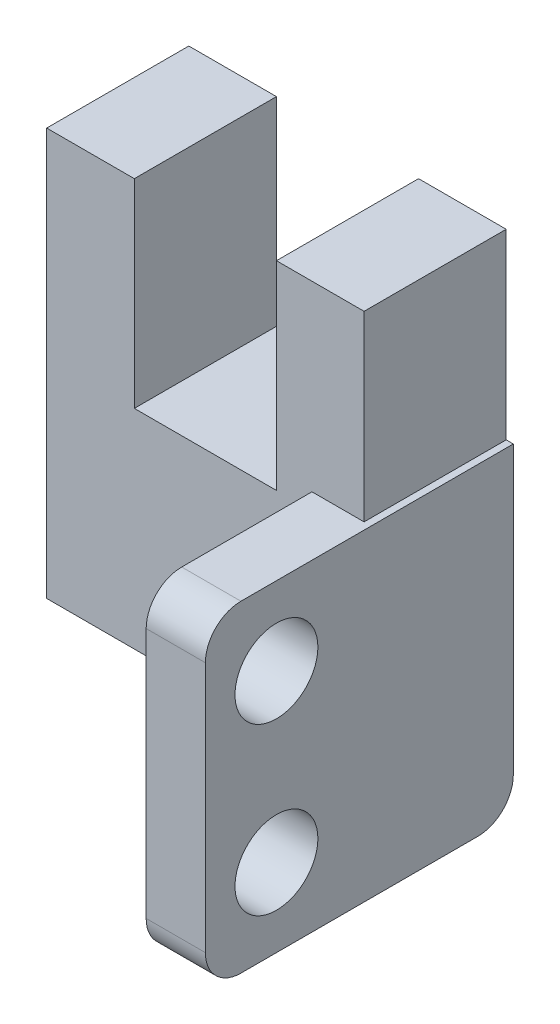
ISO-10303-21;
HEADER;
FILE_DESCRIPTION(('STEP AP214'),'2;1');
FILE_NAME('part.step','',(''),(''),'','','');
FILE_SCHEMA(('AUTOMOTIVE_DESIGN { 1 0 10303 214 1 1 1 1 }'));
ENDSEC;
DATA;
#1=APPLICATION_CONTEXT('core data for automotive mechanical design processes');
#2=APPLICATION_PROTOCOL_DEFINITION('international standard','automotive_design',2000,#1);
#3=PRODUCT_CONTEXT('',#1,'mechanical');
#4=PRODUCT('Part','Part','',(#3));
#5=PRODUCT_RELATED_PRODUCT_CATEGORY('part','',(#4));
#6=PRODUCT_DEFINITION_FORMATION('','',#4);
#7=PRODUCT_DEFINITION_CONTEXT('part definition',#1,'design');
#8=PRODUCT_DEFINITION('design','',#6,#7);
#9=PRODUCT_DEFINITION_SHAPE('','',#8);
#10=(LENGTH_UNIT() NAMED_UNIT(*) SI_UNIT(.MILLI.,.METRE.));
#11=(NAMED_UNIT(*) PLANE_ANGLE_UNIT() SI_UNIT($,.RADIAN.));
#12=(NAMED_UNIT(*) SI_UNIT($,.STERADIAN.) SOLID_ANGLE_UNIT());
#13=UNCERTAINTY_MEASURE_WITH_UNIT(LENGTH_MEASURE(1.E-05),#10,'distance_accuracy_value','');
#14=(GEOMETRIC_REPRESENTATION_CONTEXT(3) GLOBAL_UNCERTAINTY_ASSIGNED_CONTEXT((#13)) GLOBAL_UNIT_ASSIGNED_CONTEXT((#10,
#11,#12)) REPRESENTATION_CONTEXT('',''));
#15=CARTESIAN_POINT('',(0.,0.,0.));
#16=DIRECTION('',(0.,0.,1.));
#17=DIRECTION('',(1.,0.,0.));
#18=AXIS2_PLACEMENT_3D('',#15,#16,#17);
#19=CARTESIAN_POINT('',(10.9,9.5,13.));
#20=DIRECTION('',(0.,1.,0.));
#21=DIRECTION('',(0.,0.,1.));
#22=AXIS2_PLACEMENT_3D('',#19,#20,#21);
#23=PLANE('',#22);
#24=DIRECTION('',(0.,0.,-1.));
#25=VECTOR('',#24,1.);
#26=CARTESIAN_POINT('',(11.2,9.5,13.));
#27=LINE('',#26,#25);
#28=CARTESIAN_POINT('',(11.2,9.5,11.5));
#29=VERTEX_POINT('',#28);
#30=CARTESIAN_POINT('',(11.2,9.5,6.));
#31=VERTEX_POINT('',#30);
#32=EDGE_CURVE('E148',#29,#31,#27,.T.);
#33=ORIENTED_EDGE('',*,*,#32,.F.);
#34=DIRECTION('',(1.,0.,0.));
#35=VECTOR('',#34,1.);
#36=CARTESIAN_POINT('',(10.9,9.5,11.5));
#37=LINE('',#36,#35);
#38=CARTESIAN_POINT('',(13.7,9.5,11.5));
#39=VERTEX_POINT('',#38);
#40=EDGE_CURVE('E11',#29,#39,#37,.T.);
#41=ORIENTED_EDGE('',*,*,#40,.T.);
#42=DIRECTION('',(0.,0.,1.));
#43=VECTOR('',#42,1.);
#44=CARTESIAN_POINT('',(13.7,9.5,0.));
#45=LINE('',#44,#43);
#46=CARTESIAN_POINT('',(13.7,9.5,0.));
#47=VERTEX_POINT('',#46);
#48=EDGE_CURVE('E177',#47,#39,#45,.T.);
#49=ORIENTED_EDGE('',*,*,#48,.F.);
#50=DIRECTION('',(-1.,0.,0.));
#51=VECTOR('',#50,1.);
#52=CARTESIAN_POINT('',(13.7,9.5,0.));
#53=LINE('',#52,#51);
#54=CARTESIAN_POINT('',(13.4,9.5,0.));
#55=VERTEX_POINT('',#54);
#56=EDGE_CURVE('E173',#47,#55,#53,.T.);
#57=ORIENTED_EDGE('',*,*,#56,.T.);
#58=DIRECTION('',(0.,0.,1.));
#59=VECTOR('',#58,1.);
#60=CARTESIAN_POINT('',(13.4,9.5,0.));
#61=LINE('',#60,#59);
#62=CARTESIAN_POINT('',(13.4,9.5,6.));
#63=VERTEX_POINT('',#62);
#64=EDGE_CURVE('E171',#55,#63,#61,.T.);
#65=ORIENTED_EDGE('',*,*,#64,.T.);
#66=DIRECTION('',(1.,0.,0.));
#67=VECTOR('',#66,1.);
#68=CARTESIAN_POINT('',(0.,9.5,6.));
#69=LINE('',#68,#67);
#70=EDGE_CURVE('E163',#31,#63,#69,.T.);
#71=ORIENTED_EDGE('',*,*,#70,.F.);
#72=EDGE_LOOP('',(#33,#41,#49,#57,#65,#71));
#73=FACE_BOUND('',#72,.T.);
#74=ADVANCED_FACE('F35',(#73),#23,.T.);
#75=CARTESIAN_POINT('',(10.9,-4.1,0.));
#76=DIRECTION('',(0.,-1.,0.));
#77=DIRECTION('',(0.,0.,-1.));
#78=AXIS2_PLACEMENT_3D('',#75,#76,#77);
#79=PLANE('',#78);
#80=DIRECTION('',(0.,0.,1.));
#81=VECTOR('',#80,1.);
#82=CARTESIAN_POINT('',(11.2,-4.1,0.));
#83=LINE('',#82,#81);
#84=CARTESIAN_POINT('',(11.2,-4.1,1.5));
#85=VERTEX_POINT('',#84);
#86=CARTESIAN_POINT('',(11.2,-4.1,11.5));
#87=VERTEX_POINT('',#86);
#88=EDGE_CURVE('E349',#85,#87,#83,.T.);
#89=ORIENTED_EDGE('',*,*,#88,.F.);
#90=DIRECTION('',(1.,0.,0.));
#91=VECTOR('',#90,1.);
#92=CARTESIAN_POINT('',(10.9,-4.1,1.5));
#93=LINE('',#92,#91);
#94=CARTESIAN_POINT('',(13.7,-4.1,1.5));
#95=VERTEX_POINT('',#94);
#96=EDGE_CURVE('E239',#85,#95,#93,.T.);
#97=ORIENTED_EDGE('',*,*,#96,.T.);
#98=DIRECTION('',(0.,0.,-1.));
#99=VECTOR('',#98,1.);
#100=CARTESIAN_POINT('',(13.7,-4.1,13.));
#101=LINE('',#100,#99);
#102=CARTESIAN_POINT('',(13.7,-4.1,11.5));
#103=VERTEX_POINT('',#102);
#104=EDGE_CURVE('E267',#103,#95,#101,.T.);
#105=ORIENTED_EDGE('',*,*,#104,.F.);
#106=DIRECTION('',(1.,0.,0.));
#107=VECTOR('',#106,1.);
#108=CARTESIAN_POINT('',(10.9,-4.1,11.5));
#109=LINE('',#108,#107);
#110=EDGE_CURVE('E237',#103,#87,#109,.F.);
#111=ORIENTED_EDGE('',*,*,#110,.T.);
#112=EDGE_LOOP('',(#89,#97,#105,#111));
#113=FACE_BOUND('',#112,.T.);
#114=ADVANCED_FACE('F287',(#113),#79,.T.);
#115=CARTESIAN_POINT('',(10.9,-4.1,13.));
#116=DIRECTION('',(0.,0.,1.));
#117=DIRECTION('',(1.,0.,0.));
#118=AXIS2_PLACEMENT_3D('',#115,#116,#117);
#119=PLANE('',#118);
#120=DIRECTION('',(0.,1.,0.));
#121=VECTOR('',#120,1.);
#122=CARTESIAN_POINT('',(11.2,-4.1,13.));
#123=LINE('',#122,#121);
#124=CARTESIAN_POINT('',(11.2,-2.6,13.));
#125=VERTEX_POINT('',#124);
#126=CARTESIAN_POINT('',(11.2,8.,13.));
#127=VERTEX_POINT('',#126);
#128=EDGE_CURVE('E159',#125,#127,#123,.T.);
#129=ORIENTED_EDGE('',*,*,#128,.F.);
#130=DIRECTION('',(1.,0.,0.));
#131=VECTOR('',#130,1.);
#132=CARTESIAN_POINT('',(10.9,-2.6,13.));
#133=LINE('',#132,#131);
#134=CARTESIAN_POINT('',(13.7,-2.6,13.));
#135=VERTEX_POINT('',#134);
#136=EDGE_CURVE('E43',#125,#135,#133,.T.);
#137=ORIENTED_EDGE('',*,*,#136,.T.);
#138=DIRECTION('',(0.,-1.,0.));
#139=VECTOR('',#138,1.);
#140=CARTESIAN_POINT('',(13.7,9.5,13.));
#141=LINE('',#140,#139);
#142=CARTESIAN_POINT('',(13.7,8.,13.));
#143=VERTEX_POINT('',#142);
#144=EDGE_CURVE('E259',#143,#135,#141,.T.);
#145=ORIENTED_EDGE('',*,*,#144,.F.);
#146=DIRECTION('',(1.,0.,0.));
#147=VECTOR('',#146,1.);
#148=CARTESIAN_POINT('',(10.9,8.,13.));
#149=LINE('',#148,#147);
#150=EDGE_CURVE('E58',#143,#127,#149,.F.);
#151=ORIENTED_EDGE('',*,*,#150,.T.);
#152=EDGE_LOOP('',(#129,#137,#145,#151));
#153=FACE_BOUND('',#152,.T.);
#154=ADVANCED_FACE('F258',(#153),#119,.T.);
#155=CARTESIAN_POINT('',(10.9,6.2,10.));
#156=DIRECTION('',(1.,0.,0.));
#157=DIRECTION('',(0.,0.,-1.));
#158=AXIS2_PLACEMENT_3D('',#155,#156,#157);
#159=CYLINDRICAL_SURFACE('',#158,1.75);
#160=CARTESIAN_POINT('',(13.7,6.2,10.));
#161=DIRECTION('',(1.,0.,0.));
#162=DIRECTION('',(0.,0.,-1.));
#163=AXIS2_PLACEMENT_3D('',#160,#161,#162);
#164=CIRCLE('',#163,1.75);
#165=CARTESIAN_POINT('',(13.7,6.2,8.25));
#166=VERTEX_POINT('',#165);
#167=EDGE_CURVE('E271',#166,#166,#164,.T.);
#168=ORIENTED_EDGE('',*,*,#167,.T.);
#169=EDGE_LOOP('',(#168));
#170=FACE_BOUND('',#169,.T.);
#171=CARTESIAN_POINT('',(11.2,6.2,10.));
#172=DIRECTION('',(-1.,0.,0.));
#173=DIRECTION('',(0.,0.,1.));
#174=AXIS2_PLACEMENT_3D('',#171,#172,#173);
#175=CIRCLE('',#174,1.75);
#176=CARTESIAN_POINT('',(11.2,6.2,11.75));
#177=VERTEX_POINT('',#176);
#178=EDGE_CURVE('E234',#177,#177,#175,.F.);
#179=ORIENTED_EDGE('',*,*,#178,.F.);
#180=EDGE_LOOP('',(#179));
#181=FACE_BOUND('',#180,.T.);
#182=ADVANCED_FACE('F368',(#170,#181),#159,.F.);
#183=CARTESIAN_POINT('',(10.9,-0.8,10.));
#184=DIRECTION('',(1.,0.,0.));
#185=DIRECTION('',(0.,0.,-1.));
#186=AXIS2_PLACEMENT_3D('',#183,#184,#185);
#187=CYLINDRICAL_SURFACE('',#186,1.75);
#188=CARTESIAN_POINT('',(13.7,-0.8,10.));
#189=DIRECTION('',(1.,0.,0.));
#190=DIRECTION('',(0.,0.,-1.));
#191=AXIS2_PLACEMENT_3D('',#188,#189,#190);
#192=CIRCLE('',#191,1.75);
#193=CARTESIAN_POINT('',(13.7,-0.8,8.25));
#194=VERTEX_POINT('',#193);
#195=EDGE_CURVE('E361',#194,#194,#192,.T.);
#196=ORIENTED_EDGE('',*,*,#195,.T.);
#197=EDGE_LOOP('',(#196));
#198=FACE_BOUND('',#197,.T.);
#199=CARTESIAN_POINT('',(11.2,-0.8,10.));
#200=DIRECTION('',(-1.,0.,0.));
#201=DIRECTION('',(0.,0.,1.));
#202=AXIS2_PLACEMENT_3D('',#199,#200,#201);
#203=CIRCLE('',#202,1.75);
#204=CARTESIAN_POINT('',(11.2,-0.8,11.75));
#205=VERTEX_POINT('',#204);
#206=EDGE_CURVE('E231',#205,#205,#203,.F.);
#207=ORIENTED_EDGE('',*,*,#206,.F.);
#208=EDGE_LOOP('',(#207));
#209=FACE_BOUND('',#208,.T.);
#210=ADVANCED_FACE('F330',(#198,#209),#187,.F.);
#211=CARTESIAN_POINT('',(13.4,17.2,6.));
#212=DIRECTION('',(-1.,0.,0.));
#213=DIRECTION('',(0.,0.,1.));
#214=AXIS2_PLACEMENT_3D('',#211,#212,#213);
#215=PLANE('',#214);
#216=ORIENTED_EDGE('',*,*,#64,.F.);
#217=DIRECTION('',(0.,1.,0.));
#218=VECTOR('',#217,1.);
#219=CARTESIAN_POINT('',(13.4,17.2,0.));
#220=LINE('',#219,#218);
#221=CARTESIAN_POINT('',(13.4,17.2,0.));
#222=VERTEX_POINT('',#221);
#223=EDGE_CURVE('E175',#55,#222,#220,.T.);
#224=ORIENTED_EDGE('',*,*,#223,.T.);
#225=DIRECTION('',(0.,0.,-1.));
#226=VECTOR('',#225,1.);
#227=CARTESIAN_POINT('',(13.4,17.2,6.));
#228=LINE('',#227,#226);
#229=CARTESIAN_POINT('',(13.4,17.2,6.));
#230=VERTEX_POINT('',#229);
#231=EDGE_CURVE('E227',#230,#222,#228,.T.);
#232=ORIENTED_EDGE('',*,*,#231,.F.);
#233=DIRECTION('',(0.,1.,0.));
#234=VECTOR('',#233,1.);
#235=CARTESIAN_POINT('',(13.4,17.2,6.));
#236=LINE('',#235,#234);
#237=EDGE_CURVE('E182',#63,#230,#236,.T.);
#238=ORIENTED_EDGE('',*,*,#237,.F.);
#239=EDGE_LOOP('',(#216,#224,#232,#238));
#240=FACE_BOUND('',#239,.T.);
#241=ADVANCED_FACE('F327',(#240),#215,.F.);
#242=CARTESIAN_POINT('',(13.4,0.,6.));
#243=DIRECTION('',(0.,1.,0.));
#244=DIRECTION('',(0.,0.,1.));
#245=AXIS2_PLACEMENT_3D('',#242,#243,#244);
#246=PLANE('',#245);
#247=CARTESIAN_POINT('',(5.6,0.,3.));
#248=DIRECTION('',(0.,1.,0.));
#249=DIRECTION('',(0.,0.,1.));
#250=AXIS2_PLACEMENT_3D('',#247,#248,#249);
#251=CIRCLE('',#250,1.25);
#252=CARTESIAN_POINT('',(5.6,0.,4.25));
#253=VERTEX_POINT('',#252);
#254=EDGE_CURVE('E230',#253,#253,#251,.F.);
#255=ORIENTED_EDGE('',*,*,#254,.F.);
#256=EDGE_LOOP('',(#255));
#257=FACE_BOUND('',#256,.T.);
#258=DIRECTION('',(1.,0.,0.));
#259=VECTOR('',#258,1.);
#260=CARTESIAN_POINT('',(13.4,0.,0.));
#261=LINE('',#260,#259);
#262=CARTESIAN_POINT('',(0.,0.,0.));
#263=VERTEX_POINT('',#262);
#264=CARTESIAN_POINT('',(11.2,0.,0.));
#265=VERTEX_POINT('',#264);
#266=EDGE_CURVE('E172',#263,#265,#261,.T.);
#267=ORIENTED_EDGE('',*,*,#266,.T.);
#268=DIRECTION('',(0.,0.,-1.));
#269=VECTOR('',#268,1.);
#270=CARTESIAN_POINT('',(11.2,0.,6.));
#271=LINE('',#270,#269);
#272=CARTESIAN_POINT('',(11.2,0.,6.));
#273=VERTEX_POINT('',#272);
#274=EDGE_CURVE('E167',#273,#265,#271,.T.);
#275=ORIENTED_EDGE('',*,*,#274,.F.);
#276=DIRECTION('',(1.,0.,0.));
#277=VECTOR('',#276,1.);
#278=CARTESIAN_POINT('',(13.4,0.,6.));
#279=LINE('',#278,#277);
#280=CARTESIAN_POINT('',(0.,0.,6.));
#281=VERTEX_POINT('',#280);
#282=EDGE_CURVE('E166',#281,#273,#279,.T.);
#283=ORIENTED_EDGE('',*,*,#282,.F.);
#284=DIRECTION('',(0.,0.,-1.));
#285=VECTOR('',#284,1.);
#286=CARTESIAN_POINT('',(0.,0.,6.));
#287=LINE('',#286,#285);
#288=EDGE_CURVE('E196',#281,#263,#287,.T.);
#289=ORIENTED_EDGE('',*,*,#288,.T.);
#290=EDGE_LOOP('',(#267,#275,#283,#289));
#291=FACE_BOUND('',#290,.T.);
#292=ADVANCED_FACE('F325',(#257,#291),#246,.F.);
#293=CARTESIAN_POINT('',(9.7,17.2,6.));
#294=DIRECTION('',(0.,-1.,0.));
#295=DIRECTION('',(0.,0.,-1.));
#296=AXIS2_PLACEMENT_3D('',#293,#294,#295);
#297=PLANE('',#296);
#298=DIRECTION('',(-1.,0.,0.));
#299=VECTOR('',#298,1.);
#300=CARTESIAN_POINT('',(9.7,17.2,0.));
#301=LINE('',#300,#299);
#302=CARTESIAN_POINT('',(9.7,17.2,0.));
#303=VERTEX_POINT('',#302);
#304=EDGE_CURVE('E199',#222,#303,#301,.T.);
#305=ORIENTED_EDGE('',*,*,#304,.T.);
#306=DIRECTION('',(0.,0.,-1.));
#307=VECTOR('',#306,1.);
#308=CARTESIAN_POINT('',(9.7,17.2,6.));
#309=LINE('',#308,#307);
#310=CARTESIAN_POINT('',(9.7,17.2,6.));
#311=VERTEX_POINT('',#310);
#312=EDGE_CURVE('E224',#311,#303,#309,.T.);
#313=ORIENTED_EDGE('',*,*,#312,.F.);
#314=DIRECTION('',(-1.,0.,0.));
#315=VECTOR('',#314,1.);
#316=CARTESIAN_POINT('',(9.7,17.2,6.));
#317=LINE('',#316,#315);
#318=EDGE_CURVE('E185',#230,#311,#317,.T.);
#319=ORIENTED_EDGE('',*,*,#318,.F.);
#320=ORIENTED_EDGE('',*,*,#231,.T.);
#321=EDGE_LOOP('',(#305,#313,#319,#320));
#322=FACE_BOUND('',#321,.T.);
#323=ADVANCED_FACE('F321',(#322),#297,.F.);
#324=CARTESIAN_POINT('',(9.7,8.8,6.));
#325=DIRECTION('',(1.,0.,0.));
#326=DIRECTION('',(0.,0.,-1.));
#327=AXIS2_PLACEMENT_3D('',#324,#325,#326);
#328=PLANE('',#327);
#329=DIRECTION('',(0.,-1.,0.));
#330=VECTOR('',#329,1.);
#331=CARTESIAN_POINT('',(9.7,8.8,0.));
#332=LINE('',#331,#330);
#333=CARTESIAN_POINT('',(9.7,8.8,0.));
#334=VERTEX_POINT('',#333);
#335=EDGE_CURVE('E201',#303,#334,#332,.T.);
#336=ORIENTED_EDGE('',*,*,#335,.T.);
#337=DIRECTION('',(0.,0.,-1.));
#338=VECTOR('',#337,1.);
#339=CARTESIAN_POINT('',(9.7,8.8,6.));
#340=LINE('',#339,#338);
#341=CARTESIAN_POINT('',(9.7,8.8,6.));
#342=VERTEX_POINT('',#341);
#343=EDGE_CURVE('E221',#342,#334,#340,.T.);
#344=ORIENTED_EDGE('',*,*,#343,.F.);
#345=DIRECTION('',(0.,-1.,0.));
#346=VECTOR('',#345,1.);
#347=CARTESIAN_POINT('',(9.7,8.8,6.));
#348=LINE('',#347,#346);
#349=EDGE_CURVE('E187',#311,#342,#348,.T.);
#350=ORIENTED_EDGE('',*,*,#349,.F.);
#351=ORIENTED_EDGE('',*,*,#312,.T.);
#352=EDGE_LOOP('',(#336,#344,#350,#351));
#353=FACE_BOUND('',#352,.T.);
#354=ADVANCED_FACE('F317',(#353),#328,.F.);
#355=CARTESIAN_POINT('',(3.7,8.8,6.));
#356=DIRECTION('',(0.,-1.,0.));
#357=DIRECTION('',(0.,0.,-1.));
#358=AXIS2_PLACEMENT_3D('',#355,#356,#357);
#359=PLANE('',#358);
#360=DIRECTION('',(-1.,0.,0.));
#361=VECTOR('',#360,1.);
#362=CARTESIAN_POINT('',(3.7,8.8,0.));
#363=LINE('',#362,#361);
#364=CARTESIAN_POINT('',(3.7,8.8,0.));
#365=VERTEX_POINT('',#364);
#366=EDGE_CURVE('E203',#334,#365,#363,.T.);
#367=ORIENTED_EDGE('',*,*,#366,.T.);
#368=DIRECTION('',(0.,0.,-1.));
#369=VECTOR('',#368,1.);
#370=CARTESIAN_POINT('',(3.7,8.8,6.));
#371=LINE('',#370,#369);
#372=CARTESIAN_POINT('',(3.7,8.8,6.));
#373=VERTEX_POINT('',#372);
#374=EDGE_CURVE('E218',#373,#365,#371,.T.);
#375=ORIENTED_EDGE('',*,*,#374,.F.);
#376=DIRECTION('',(-1.,0.,0.));
#377=VECTOR('',#376,1.);
#378=CARTESIAN_POINT('',(3.7,8.8,6.));
#379=LINE('',#378,#377);
#380=EDGE_CURVE('E189',#342,#373,#379,.T.);
#381=ORIENTED_EDGE('',*,*,#380,.F.);
#382=ORIENTED_EDGE('',*,*,#343,.T.);
#383=EDGE_LOOP('',(#367,#375,#381,#382));
#384=FACE_BOUND('',#383,.T.);
#385=ADVANCED_FACE('F313',(#384),#359,.F.);
#386=CARTESIAN_POINT('',(3.7,17.2,6.));
#387=DIRECTION('',(-1.,0.,0.));
#388=DIRECTION('',(0.,-1.,0.));
#389=AXIS2_PLACEMENT_3D('',#386,#387,#388);
#390=PLANE('',#389);
#391=DIRECTION('',(0.,1.,0.));
#392=VECTOR('',#391,1.);
#393=CARTESIAN_POINT('',(3.7,17.2,0.));
#394=LINE('',#393,#392);
#395=CARTESIAN_POINT('',(3.7,17.2,0.));
#396=VERTEX_POINT('',#395);
#397=EDGE_CURVE('E205',#365,#396,#394,.T.);
#398=ORIENTED_EDGE('',*,*,#397,.T.);
#399=DIRECTION('',(0.,0.,-1.));
#400=VECTOR('',#399,1.);
#401=CARTESIAN_POINT('',(3.7,17.2,6.));
#402=LINE('',#401,#400);
#403=CARTESIAN_POINT('',(3.7,17.2,6.));
#404=VERTEX_POINT('',#403);
#405=EDGE_CURVE('E215',#404,#396,#402,.T.);
#406=ORIENTED_EDGE('',*,*,#405,.F.);
#407=DIRECTION('',(0.,1.,0.));
#408=VECTOR('',#407,1.);
#409=CARTESIAN_POINT('',(3.7,17.2,6.));
#410=LINE('',#409,#408);
#411=EDGE_CURVE('E191',#373,#404,#410,.T.);
#412=ORIENTED_EDGE('',*,*,#411,.F.);
#413=ORIENTED_EDGE('',*,*,#374,.T.);
#414=EDGE_LOOP('',(#398,#406,#412,#413));
#415=FACE_BOUND('',#414,.T.);
#416=ADVANCED_FACE('F309',(#415),#390,.F.);
#417=CARTESIAN_POINT('',(0.,17.2,6.));
#418=DIRECTION('',(0.,-1.,0.));
#419=DIRECTION('',(0.,0.,-1.));
#420=AXIS2_PLACEMENT_3D('',#417,#418,#419);
#421=PLANE('',#420);
#422=DIRECTION('',(-1.,0.,0.));
#423=VECTOR('',#422,1.);
#424=CARTESIAN_POINT('',(0.,17.2,0.));
#425=LINE('',#424,#423);
#426=CARTESIAN_POINT('',(0.,17.2,0.));
#427=VERTEX_POINT('',#426);
#428=EDGE_CURVE('E207',#396,#427,#425,.T.);
#429=ORIENTED_EDGE('',*,*,#428,.T.);
#430=DIRECTION('',(0.,0.,-1.));
#431=VECTOR('',#430,1.);
#432=CARTESIAN_POINT('',(0.,17.2,6.));
#433=LINE('',#432,#431);
#434=CARTESIAN_POINT('',(0.,17.2,6.));
#435=VERTEX_POINT('',#434);
#436=EDGE_CURVE('E212',#435,#427,#433,.T.);
#437=ORIENTED_EDGE('',*,*,#436,.F.);
#438=DIRECTION('',(-1.,0.,0.));
#439=VECTOR('',#438,1.);
#440=CARTESIAN_POINT('',(0.,17.2,6.));
#441=LINE('',#440,#439);
#442=EDGE_CURVE('E193',#404,#435,#441,.T.);
#443=ORIENTED_EDGE('',*,*,#442,.F.);
#444=ORIENTED_EDGE('',*,*,#405,.T.);
#445=EDGE_LOOP('',(#429,#437,#443,#444));
#446=FACE_BOUND('',#445,.T.);
#447=ADVANCED_FACE('F305',(#446),#421,.F.);
#448=CARTESIAN_POINT('',(0.,0.,6.));
#449=DIRECTION('',(1.,0.,0.));
#450=DIRECTION('',(0.,0.,-1.));
#451=AXIS2_PLACEMENT_3D('',#448,#449,#450);
#452=PLANE('',#451);
#453=DIRECTION('',(0.,-1.,0.));
#454=VECTOR('',#453,1.);
#455=CARTESIAN_POINT('',(0.,0.,0.));
#456=LINE('',#455,#454);
#457=EDGE_CURVE('E183',#427,#263,#456,.T.);
#458=ORIENTED_EDGE('',*,*,#457,.T.);
#459=ORIENTED_EDGE('',*,*,#288,.F.);
#460=DIRECTION('',(0.,-1.,0.));
#461=VECTOR('',#460,1.);
#462=CARTESIAN_POINT('',(0.,0.,6.));
#463=LINE('',#462,#461);
#464=EDGE_CURVE('E195',#435,#281,#463,.T.);
#465=ORIENTED_EDGE('',*,*,#464,.F.);
#466=ORIENTED_EDGE('',*,*,#436,.T.);
#467=EDGE_LOOP('',(#458,#459,#465,#466));
#468=FACE_BOUND('',#467,.T.);
#469=ADVANCED_FACE('F299',(#468),#452,.F.);
#470=CARTESIAN_POINT('',(0.,0.,6.));
#471=DIRECTION('',(0.,0.,-1.));
#472=DIRECTION('',(-1.,0.,0.));
#473=AXIS2_PLACEMENT_3D('',#470,#471,#472);
#474=PLANE('',#473);
#475=DIRECTION('',(0.,-1.,0.));
#476=VECTOR('',#475,1.);
#477=CARTESIAN_POINT('',(11.2,9.5,6.));
#478=LINE('',#477,#476);
#479=EDGE_CURVE('E154',#31,#273,#478,.T.);
#480=ORIENTED_EDGE('',*,*,#479,.F.);
#481=ORIENTED_EDGE('',*,*,#70,.T.);
#482=ORIENTED_EDGE('',*,*,#237,.T.);
#483=ORIENTED_EDGE('',*,*,#318,.T.);
#484=ORIENTED_EDGE('',*,*,#349,.T.);
#485=ORIENTED_EDGE('',*,*,#380,.T.);
#486=ORIENTED_EDGE('',*,*,#411,.T.);
#487=ORIENTED_EDGE('',*,*,#442,.T.);
#488=ORIENTED_EDGE('',*,*,#464,.T.);
#489=ORIENTED_EDGE('',*,*,#282,.T.);
#490=EDGE_LOOP('',(#480,#481,#482,#483,#484,#485,#486,#487,#488,#489));
#491=FACE_BOUND('',#490,.T.);
#492=ADVANCED_FACE('F162',(#491),#474,.F.);
#493=CARTESIAN_POINT('',(0.,0.,0.));
#494=DIRECTION('',(0.,0.,-1.));
#495=DIRECTION('',(-1.,0.,0.));
#496=AXIS2_PLACEMENT_3D('',#493,#494,#495);
#497=PLANE('',#496);
#498=DIRECTION('',(0.,1.,0.));
#499=VECTOR('',#498,1.);
#500=CARTESIAN_POINT('',(13.7,-4.1,0.));
#501=LINE('',#500,#499);
#502=CARTESIAN_POINT('',(13.7,-2.6,0.));
#503=VERTEX_POINT('',#502);
#504=EDGE_CURVE('E269',#503,#47,#501,.T.);
#505=ORIENTED_EDGE('',*,*,#504,.F.);
#506=DIRECTION('',(1.,0.,0.));
#507=VECTOR('',#506,1.);
#508=CARTESIAN_POINT('',(0.,-2.6,0.));
#509=LINE('',#508,#507);
#510=CARTESIAN_POINT('',(11.2,-2.6,0.));
#511=VERTEX_POINT('',#510);
#512=EDGE_CURVE('E248',#503,#511,#509,.F.);
#513=ORIENTED_EDGE('',*,*,#512,.T.);
#514=DIRECTION('',(0.,-1.,0.));
#515=VECTOR('',#514,1.);
#516=CARTESIAN_POINT('',(11.2,0.,0.));
#517=LINE('',#516,#515);
#518=EDGE_CURVE('E351',#265,#511,#517,.T.);
#519=ORIENTED_EDGE('',*,*,#518,.F.);
#520=ORIENTED_EDGE('',*,*,#266,.F.);
#521=ORIENTED_EDGE('',*,*,#457,.F.);
#522=ORIENTED_EDGE('',*,*,#428,.F.);
#523=ORIENTED_EDGE('',*,*,#397,.F.);
#524=ORIENTED_EDGE('',*,*,#366,.F.);
#525=ORIENTED_EDGE('',*,*,#335,.F.);
#526=ORIENTED_EDGE('',*,*,#304,.F.);
#527=ORIENTED_EDGE('',*,*,#223,.F.);
#528=ORIENTED_EDGE('',*,*,#56,.F.);
#529=EDGE_LOOP('',(#505,#513,#519,#520,#521,#522,#523,#524,#525,#526,#527,#528));
#530=FACE_BOUND('',#529,.T.);
#531=ADVANCED_FACE('F298',(#530),#497,.T.);
#532=CARTESIAN_POINT('',(13.7,0.,0.));
#533=DIRECTION('',(1.,0.,0.));
#534=DIRECTION('',(0.,0.,-1.));
#535=AXIS2_PLACEMENT_3D('',#532,#533,#534);
#536=PLANE('',#535);
#537=ORIENTED_EDGE('',*,*,#195,.F.);
#538=EDGE_LOOP('',(#537));
#539=FACE_BOUND('',#538,.T.);
#540=ORIENTED_EDGE('',*,*,#167,.F.);
#541=EDGE_LOOP('',(#540));
#542=FACE_BOUND('',#541,.T.);
#543=ORIENTED_EDGE('',*,*,#104,.T.);
#544=CARTESIAN_POINT('',(13.7,-2.6,1.5));
#545=DIRECTION('',(1.,0.,0.));
#546=DIRECTION('',(0.,0.,-1.));
#547=AXIS2_PLACEMENT_3D('',#544,#545,#546);
#548=CIRCLE('',#547,1.5);
#549=EDGE_CURVE('E246',#95,#503,#548,.T.);
#550=ORIENTED_EDGE('',*,*,#549,.T.);
#551=ORIENTED_EDGE('',*,*,#504,.T.);
#552=ORIENTED_EDGE('',*,*,#48,.T.);
#553=CARTESIAN_POINT('',(13.7,8.,11.5));
#554=DIRECTION('',(1.,0.,0.));
#555=DIRECTION('',(0.,0.,-1.));
#556=AXIS2_PLACEMENT_3D('',#553,#554,#555);
#557=CIRCLE('',#556,1.5);
#558=EDGE_CURVE('E242',#39,#143,#557,.T.);
#559=ORIENTED_EDGE('',*,*,#558,.T.);
#560=ORIENTED_EDGE('',*,*,#144,.T.);
#561=CARTESIAN_POINT('',(13.7,-2.6,11.5));
#562=DIRECTION('',(1.,0.,0.));
#563=DIRECTION('',(0.,0.,-1.));
#564=AXIS2_PLACEMENT_3D('',#561,#562,#563);
#565=CIRCLE('',#564,1.5);
#566=EDGE_CURVE('E244',#135,#103,#565,.T.);
#567=ORIENTED_EDGE('',*,*,#566,.T.);
#568=EDGE_LOOP('',(#543,#550,#551,#552,#559,#560,#567));
#569=FACE_BOUND('',#568,.T.);
#570=ADVANCED_FACE('F264',(#539,#542,#569),#536,.T.);
#571=CARTESIAN_POINT('',(11.2,0.,0.));
#572=DIRECTION('',(-1.,0.,0.));
#573=DIRECTION('',(0.,0.,1.));
#574=AXIS2_PLACEMENT_3D('',#571,#572,#573);
#575=PLANE('',#574);
#576=ORIENTED_EDGE('',*,*,#518,.T.);
#577=CARTESIAN_POINT('',(11.2,-2.6,1.5));
#578=DIRECTION('',(-1.,0.,0.));
#579=DIRECTION('',(0.,0.,1.));
#580=AXIS2_PLACEMENT_3D('',#577,#578,#579);
#581=CIRCLE('',#580,1.5);
#582=EDGE_CURVE('E253',#511,#85,#581,.T.);
#583=ORIENTED_EDGE('',*,*,#582,.T.);
#584=ORIENTED_EDGE('',*,*,#88,.T.);
#585=CARTESIAN_POINT('',(11.2,-2.6,11.5));
#586=DIRECTION('',(-1.,0.,0.));
#587=DIRECTION('',(0.,0.,1.));
#588=AXIS2_PLACEMENT_3D('',#585,#586,#587);
#589=CIRCLE('',#588,1.5);
#590=EDGE_CURVE('E251',#87,#125,#589,.T.);
#591=ORIENTED_EDGE('',*,*,#590,.T.);
#592=ORIENTED_EDGE('',*,*,#128,.T.);
#593=CARTESIAN_POINT('',(11.2,8.,11.5));
#594=DIRECTION('',(-1.,0.,0.));
#595=DIRECTION('',(0.,0.,1.));
#596=AXIS2_PLACEMENT_3D('',#593,#594,#595);
#597=CIRCLE('',#596,1.5);
#598=EDGE_CURVE('E50',#127,#29,#597,.T.);
#599=ORIENTED_EDGE('',*,*,#598,.T.);
#600=ORIENTED_EDGE('',*,*,#32,.T.);
#601=ORIENTED_EDGE('',*,*,#479,.T.);
#602=ORIENTED_EDGE('',*,*,#274,.T.);
#603=EDGE_LOOP('',(#576,#583,#584,#591,#592,#599,#600,#601,#602));
#604=FACE_BOUND('',#603,.T.);
#605=ORIENTED_EDGE('',*,*,#206,.T.);
#606=EDGE_LOOP('',(#605));
#607=FACE_BOUND('',#606,.T.);
#608=ORIENTED_EDGE('',*,*,#178,.T.);
#609=EDGE_LOOP('',(#608));
#610=FACE_BOUND('',#609,.T.);
#611=ADVANCED_FACE('F151',(#604,#607,#610),#575,.T.);
#612=CARTESIAN_POINT('',(5.6,-10.,3.));
#613=DIRECTION('',(0.,1.,0.));
#614=DIRECTION('',(0.,0.,1.));
#615=AXIS2_PLACEMENT_3D('',#612,#613,#614);
#616=CYLINDRICAL_SURFACE('',#615,1.25);
#617=CARTESIAN_POINT('',(5.6,-10.,3.));
#618=DIRECTION('',(0.,-1.,0.));
#619=DIRECTION('',(0.,0.,-1.));
#620=AXIS2_PLACEMENT_3D('',#617,#618,#619);
#621=CIRCLE('',#620,1.25);
#622=CARTESIAN_POINT('',(5.6,-10.,1.75));
#623=VERTEX_POINT('',#622);
#624=EDGE_CURVE('E355',#623,#623,#621,.T.);
#625=ORIENTED_EDGE('',*,*,#624,.F.);
#626=EDGE_LOOP('',(#625));
#627=FACE_BOUND('',#626,.T.);
#628=ORIENTED_EDGE('',*,*,#254,.T.);
#629=EDGE_LOOP('',(#628));
#630=FACE_BOUND('',#629,.T.);
#631=ADVANCED_FACE('F341',(#627,#630),#616,.T.);
#632=CARTESIAN_POINT('',(5.6,-10.,3.));
#633=DIRECTION('',(0.,-1.,0.));
#634=DIRECTION('',(0.,0.,-1.));
#635=AXIS2_PLACEMENT_3D('',#632,#633,#634);
#636=PLANE('',#635);
#637=ORIENTED_EDGE('',*,*,#624,.T.);
#638=EDGE_LOOP('',(#637));
#639=FACE_BOUND('',#638,.T.);
#640=ADVANCED_FACE('F336',(#639),#636,.T.);
#641=CARTESIAN_POINT('',(10.9,-2.6,1.5));
#642=DIRECTION('',(1.,0.,0.));
#643=DIRECTION('',(0.,0.,-1.));
#644=AXIS2_PLACEMENT_3D('',#641,#642,#643);
#645=CYLINDRICAL_SURFACE('',#644,1.5);
#646=ORIENTED_EDGE('',*,*,#582,.F.);
#647=ORIENTED_EDGE('',*,*,#512,.F.);
#648=ORIENTED_EDGE('',*,*,#549,.F.);
#649=ORIENTED_EDGE('',*,*,#96,.F.);
#650=EDGE_LOOP('',(#646,#647,#648,#649));
#651=FACE_BOUND('',#650,.T.);
#652=ADVANCED_FACE('F285',(#651),#645,.T.);
#653=CARTESIAN_POINT('',(10.9,-2.6,11.5));
#654=DIRECTION('',(1.,0.,0.));
#655=DIRECTION('',(0.,0.,-1.));
#656=AXIS2_PLACEMENT_3D('',#653,#654,#655);
#657=CYLINDRICAL_SURFACE('',#656,1.5);
#658=ORIENTED_EDGE('',*,*,#590,.F.);
#659=ORIENTED_EDGE('',*,*,#110,.F.);
#660=ORIENTED_EDGE('',*,*,#566,.F.);
#661=ORIENTED_EDGE('',*,*,#136,.F.);
#662=EDGE_LOOP('',(#658,#659,#660,#661));
#663=FACE_BOUND('',#662,.T.);
#664=ADVANCED_FACE('F281',(#663),#657,.T.);
#665=CARTESIAN_POINT('',(10.9,8.,11.5));
#666=DIRECTION('',(1.,0.,0.));
#667=DIRECTION('',(0.,0.,-1.));
#668=AXIS2_PLACEMENT_3D('',#665,#666,#667);
#669=CYLINDRICAL_SURFACE('',#668,1.5);
#670=ORIENTED_EDGE('',*,*,#598,.F.);
#671=ORIENTED_EDGE('',*,*,#150,.F.);
#672=ORIENTED_EDGE('',*,*,#558,.F.);
#673=ORIENTED_EDGE('',*,*,#40,.F.);
#674=EDGE_LOOP('',(#670,#671,#672,#673));
#675=FACE_BOUND('',#674,.T.);
#676=ADVANCED_FACE('F37',(#675),#669,.T.);
#677=CLOSED_SHELL('',(#74,#114,#154,#182,#210,#241,#292,#323,#354,#385,#416,#447,#469,#492,#531,
#570,#611,#631,#640,#652,#664,#676));
#678=MANIFOLD_SOLID_BREP('B2',#677);
#679=ADVANCED_BREP_SHAPE_REPRESENTATION('',(#18,#678),#14);
#680=SHAPE_DEFINITION_REPRESENTATION(#9,#679);
ENDSEC;
END-ISO-10303-21;
